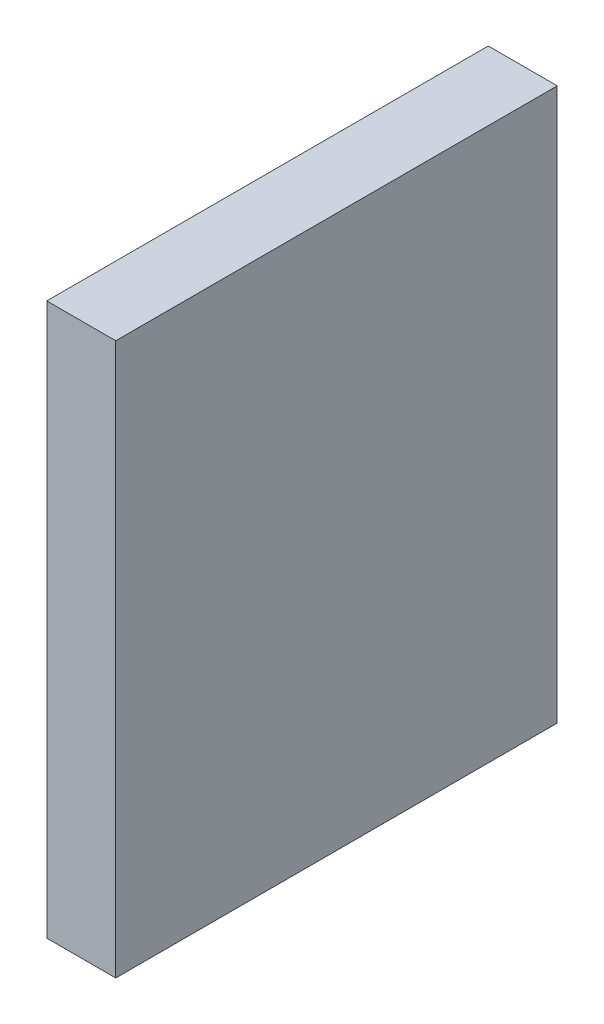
from build123d import *

# Parameters (mm, degrees)
SKETCH_1_W      = 64
SKETCH_1_H      = 80
EXTRUDE_1_DEPTH = 10


with BuildPart() as part:
    # Sketch 1 → Extrude 1 (new body)
    with BuildSketch(Plane(origin=(0, 0, 0), x_dir=(0, 0, -1), z_dir=(1, 0, 0))):
        with Locations((32, 40)):
            Rectangle(SKETCH_1_W, SKETCH_1_H)
    extrude(amount=EXTRUDE_1_DEPTH)


solid = part.part
